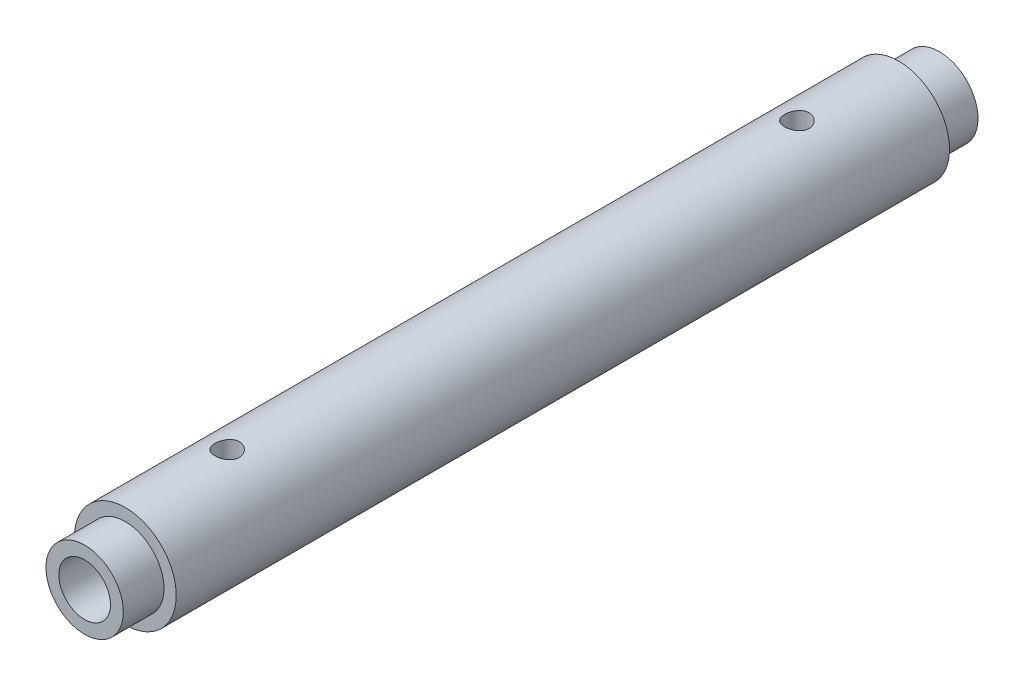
from build123d import *

# Parameters (mm, degrees)
SKETCH_2_R          = 3
CUT_EXTRUDE_1_DEPTH = 15


with BuildPart() as part:
    # Sketch 1 → Revolve 1 (revolve)
    with BuildSketch(Plane(origin=(0, 0, 0), x_dir=(0, 0, -1), z_dir=(1, 0, 0))):
        Polygon((0, 0), (0, 6.35), (-50, 6.35), (-50, 9.5), (-40, 9.5), (-40, 12.5), (150, 12.5), (150, 9.5), (160, 9.5), (160, 6.35), (110, 6.35), (110, 0), align=None)
    revolve(axis=Axis((0, 0, -110), (0, 0, 1)))

    # Sketch 2 → Cut-Extrude 1 (cut, symmetric)
    with BuildSketch(Plane(origin=(0, 0, 0), x_dir=(1, 0, 0), z_dir=(0, 1, 0))):
        with Locations(Location((0, -15, 0), (0, 0, 270))):
            Circle(SKETCH_2_R)
        with Locations(Location((0, 125, 0), (0, 0, 270))):
            Circle(SKETCH_2_R)
    extrude(amount=CUT_EXTRUDE_1_DEPTH, both=True, mode=Mode.SUBTRACT)


solid = part.part
